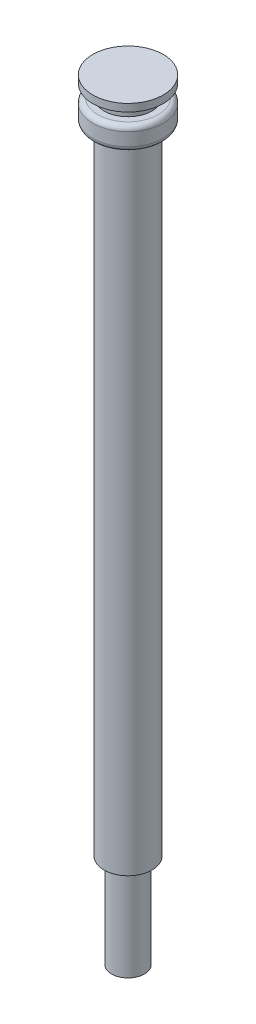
ISO-10303-21;
HEADER;
FILE_DESCRIPTION(('STEP AP214'),'2;1');
FILE_NAME('part.step','',(''),(''),'','','');
FILE_SCHEMA(('AUTOMOTIVE_DESIGN { 1 0 10303 214 1 1 1 1 }'));
ENDSEC;
DATA;
#1=APPLICATION_CONTEXT('core data for automotive mechanical design processes');
#2=APPLICATION_PROTOCOL_DEFINITION('international standard','automotive_design',2000,#1);
#3=PRODUCT_CONTEXT('',#1,'mechanical');
#4=PRODUCT('Part','Part','',(#3));
#5=PRODUCT_RELATED_PRODUCT_CATEGORY('part','',(#4));
#6=PRODUCT_DEFINITION_FORMATION('','',#4);
#7=PRODUCT_DEFINITION_CONTEXT('part definition',#1,'design');
#8=PRODUCT_DEFINITION('design','',#6,#7);
#9=PRODUCT_DEFINITION_SHAPE('','',#8);
#10=(LENGTH_UNIT() NAMED_UNIT(*) SI_UNIT(.MILLI.,.METRE.));
#11=(NAMED_UNIT(*) PLANE_ANGLE_UNIT() SI_UNIT($,.RADIAN.));
#12=(NAMED_UNIT(*) SI_UNIT($,.STERADIAN.) SOLID_ANGLE_UNIT());
#13=UNCERTAINTY_MEASURE_WITH_UNIT(LENGTH_MEASURE(1.E-05),#10,'distance_accuracy_value','');
#14=(GEOMETRIC_REPRESENTATION_CONTEXT(3) GLOBAL_UNCERTAINTY_ASSIGNED_CONTEXT((#13)) GLOBAL_UNIT_ASSIGNED_CONTEXT((#10,
#11,#12)) REPRESENTATION_CONTEXT('',''));
#15=CARTESIAN_POINT('',(0.,0.,0.));
#16=DIRECTION('',(0.,0.,1.));
#17=DIRECTION('',(1.,0.,0.));
#18=AXIS2_PLACEMENT_3D('',#15,#16,#17);
#19=CARTESIAN_POINT('',(1.6637,0.,0.));
#20=DIRECTION('',(0.,-1.,0.));
#21=DIRECTION('',(0.,0.,-1.));
#22=AXIS2_PLACEMENT_3D('',#19,#20,#21);
#23=PLANE('',#22);
#24=CARTESIAN_POINT('',(0.,0.,0.));
#25=DIRECTION('',(0.,-1.,0.));
#26=DIRECTION('',(0.,0.,-1.));
#27=AXIS2_PLACEMENT_3D('',#24,#25,#26);
#28=CIRCLE('',#27,1.6637);
#29=CARTESIAN_POINT('',(0.,0.,-1.6637));
#30=VERTEX_POINT('',#29);
#31=EDGE_CURVE('E53',#30,#30,#28,.T.);
#32=ORIENTED_EDGE('',*,*,#31,.T.);
#33=EDGE_LOOP('',(#32));
#34=FACE_BOUND('',#33,.T.);
#35=ADVANCED_FACE('F33',(#34),#23,.T.);
#36=CARTESIAN_POINT('',(0.,0.,0.));
#37=DIRECTION('',(0.,-1.,0.));
#38=DIRECTION('',(0.,0.,-1.));
#39=AXIS2_PLACEMENT_3D('',#36,#37,#38);
#40=CYLINDRICAL_SURFACE('',#39,1.6637);
#41=CARTESIAN_POINT('',(0.,9.525,0.));
#42=DIRECTION('',(0.,-1.,0.));
#43=DIRECTION('',(0.,0.,-1.));
#44=AXIS2_PLACEMENT_3D('',#41,#42,#43);
#45=CIRCLE('',#44,1.6637);
#46=CARTESIAN_POINT('',(0.,9.525,-1.6637));
#47=VERTEX_POINT('',#46);
#48=EDGE_CURVE('E56',#47,#47,#45,.T.);
#49=ORIENTED_EDGE('',*,*,#48,.T.);
#50=EDGE_LOOP('',(#49));
#51=FACE_BOUND('',#50,.T.);
#52=ORIENTED_EDGE('',*,*,#31,.F.);
#53=EDGE_LOOP('',(#52));
#54=FACE_BOUND('',#53,.T.);
#55=ADVANCED_FACE('F93',(#51,#54),#40,.T.);
#56=CARTESIAN_POINT('',(2.4384,9.525,0.));
#57=DIRECTION('',(0.,-1.,0.));
#58=DIRECTION('',(0.,0.,-1.));
#59=AXIS2_PLACEMENT_3D('',#56,#57,#58);
#60=PLANE('',#59);
#61=CARTESIAN_POINT('',(0.,9.525,0.));
#62=DIRECTION('',(0.,-1.,0.));
#63=DIRECTION('',(0.,0.,-1.));
#64=AXIS2_PLACEMENT_3D('',#61,#62,#63);
#65=CIRCLE('',#64,2.4384);
#66=CARTESIAN_POINT('',(0.,9.525,-2.4384));
#67=VERTEX_POINT('',#66);
#68=EDGE_CURVE('E59',#67,#67,#65,.T.);
#69=ORIENTED_EDGE('',*,*,#68,.T.);
#70=EDGE_LOOP('',(#69));
#71=FACE_BOUND('',#70,.T.);
#72=ORIENTED_EDGE('',*,*,#48,.F.);
#73=EDGE_LOOP('',(#72));
#74=FACE_BOUND('',#73,.T.);
#75=ADVANCED_FACE('F99',(#71,#74),#60,.T.);
#76=CARTESIAN_POINT('',(0.,0.,0.));
#77=DIRECTION('',(0.,-1.,0.));
#78=DIRECTION('',(0.,0.,-1.));
#79=AXIS2_PLACEMENT_3D('',#76,#77,#78);
#80=CYLINDRICAL_SURFACE('',#79,2.4384);
#81=CARTESIAN_POINT('',(0.,73.8632,0.));
#82=DIRECTION('',(0.,-1.,0.));
#83=DIRECTION('',(0.,0.,-1.));
#84=AXIS2_PLACEMENT_3D('',#81,#82,#83);
#85=CIRCLE('',#84,2.4384);
#86=CARTESIAN_POINT('',(0.,73.8632,-2.4384));
#87=VERTEX_POINT('',#86);
#88=EDGE_CURVE('E62',#87,#87,#85,.T.);
#89=ORIENTED_EDGE('',*,*,#88,.T.);
#90=EDGE_LOOP('',(#89));
#91=FACE_BOUND('',#90,.T.);
#92=ORIENTED_EDGE('',*,*,#68,.F.);
#93=EDGE_LOOP('',(#92));
#94=FACE_BOUND('',#93,.T.);
#95=ADVANCED_FACE('F105',(#91,#94),#80,.T.);
#96=CARTESIAN_POINT('',(2.4384,73.8632,0.));
#97=DIRECTION('',(0.,-1.,0.));
#98=DIRECTION('',(0.,0.,-1.));
#99=AXIS2_PLACEMENT_3D('',#96,#97,#98);
#100=PLANE('',#99);
#101=CARTESIAN_POINT('',(0.,73.8632,0.));
#102=DIRECTION('',(0.,-1.,0.));
#103=DIRECTION('',(0.,0.,-1.));
#104=AXIS2_PLACEMENT_3D('',#101,#102,#103);
#105=CIRCLE('',#104,3.0607);
#106=CARTESIAN_POINT('',(0.,73.8632,-3.0607));
#107=VERTEX_POINT('',#106);
#108=EDGE_CURVE('E10',#107,#107,#105,.T.);
#109=ORIENTED_EDGE('',*,*,#108,.T.);
#110=EDGE_LOOP('',(#109));
#111=FACE_BOUND('',#110,.T.);
#112=ORIENTED_EDGE('',*,*,#88,.F.);
#113=EDGE_LOOP('',(#112));
#114=FACE_BOUND('',#113,.T.);
#115=ADVANCED_FACE('F109',(#111,#114),#100,.T.);
#116=CARTESIAN_POINT('',(0.,0.,0.));
#117=DIRECTION('',(0.,-1.,0.));
#118=DIRECTION('',(0.,0.,-1.));
#119=AXIS2_PLACEMENT_3D('',#116,#117,#118);
#120=CYLINDRICAL_SURFACE('',#119,3.5687);
#121=CARTESIAN_POINT('',(0.,75.692,0.));
#122=DIRECTION('',(0.,1.,0.));
#123=DIRECTION('',(0.,0.,1.));
#124=AXIS2_PLACEMENT_3D('',#121,#122,#123);
#125=CIRCLE('',#124,3.5687);
#126=CARTESIAN_POINT('',(0.,75.692,3.5687));
#127=VERTEX_POINT('',#126);
#128=EDGE_CURVE('E44',#127,#127,#125,.F.);
#129=ORIENTED_EDGE('',*,*,#128,.T.);
#130=EDGE_LOOP('',(#129));
#131=FACE_BOUND('',#130,.T.);
#132=CARTESIAN_POINT('',(0.,74.3712,0.));
#133=DIRECTION('',(0.,-1.,0.));
#134=DIRECTION('',(0.,0.,-1.));
#135=AXIS2_PLACEMENT_3D('',#132,#133,#134);
#136=CIRCLE('',#135,3.5687);
#137=CARTESIAN_POINT('',(0.,74.3712,-3.5687));
#138=VERTEX_POINT('',#137);
#139=EDGE_CURVE('E48',#138,#138,#136,.F.);
#140=ORIENTED_EDGE('',*,*,#139,.T.);
#141=EDGE_LOOP('',(#140));
#142=FACE_BOUND('',#141,.T.);
#143=ADVANCED_FACE('F113',(#131,#142),#120,.T.);
#144=CARTESIAN_POINT('',(3.5687,76.2,0.));
#145=DIRECTION('',(0.,1.,0.));
#146=DIRECTION('',(0.,0.,1.));
#147=AXIS2_PLACEMENT_3D('',#144,#145,#146);
#148=PLANE('',#147);
#149=CARTESIAN_POINT('',(0.,76.2,0.));
#150=DIRECTION('',(0.,1.,0.));
#151=DIRECTION('',(0.,0.,1.));
#152=AXIS2_PLACEMENT_3D('',#149,#150,#151);
#153=CIRCLE('',#152,3.0607);
#154=CARTESIAN_POINT('',(0.,76.2,3.0607));
#155=VERTEX_POINT('',#154);
#156=EDGE_CURVE('E40',#155,#155,#153,.T.);
#157=ORIENTED_EDGE('',*,*,#156,.T.);
#158=EDGE_LOOP('',(#157));
#159=FACE_BOUND('',#158,.T.);
#160=CARTESIAN_POINT('',(0.,76.2,0.));
#161=DIRECTION('',(0.,-1.,0.));
#162=DIRECTION('',(0.,0.,-1.));
#163=AXIS2_PLACEMENT_3D('',#160,#161,#162);
#164=CIRCLE('',#163,2.4257);
#165=CARTESIAN_POINT('',(0.,76.2,-2.4257));
#166=VERTEX_POINT('',#165);
#167=EDGE_CURVE('E65',#166,#166,#164,.T.);
#168=ORIENTED_EDGE('',*,*,#167,.T.);
#169=EDGE_LOOP('',(#168));
#170=FACE_BOUND('',#169,.T.);
#171=ADVANCED_FACE('F116',(#159,#170),#148,.T.);
#172=CARTESIAN_POINT('',(0.,0.,0.));
#173=DIRECTION('',(0.,-1.,0.));
#174=DIRECTION('',(0.,0.,-1.));
#175=AXIS2_PLACEMENT_3D('',#172,#173,#174);
#176=CYLINDRICAL_SURFACE('',#175,2.4257);
#177=CARTESIAN_POINT('',(0.,77.4192,0.));
#178=DIRECTION('',(0.,-1.,0.));
#179=DIRECTION('',(0.,0.,-1.));
#180=AXIS2_PLACEMENT_3D('',#177,#178,#179);
#181=CIRCLE('',#180,2.4257);
#182=CARTESIAN_POINT('',(0.,77.4192,-2.4257));
#183=VERTEX_POINT('',#182);
#184=EDGE_CURVE('E68',#183,#183,#181,.T.);
#185=ORIENTED_EDGE('',*,*,#184,.T.);
#186=EDGE_LOOP('',(#185));
#187=FACE_BOUND('',#186,.T.);
#188=ORIENTED_EDGE('',*,*,#167,.F.);
#189=EDGE_LOOP('',(#188));
#190=FACE_BOUND('',#189,.T.);
#191=ADVANCED_FACE('F120',(#187,#190),#176,.T.);
#192=CARTESIAN_POINT('',(2.4257,77.4192,0.));
#193=DIRECTION('',(0.,-1.,0.));
#194=DIRECTION('',(0.,0.,-1.));
#195=AXIS2_PLACEMENT_3D('',#192,#193,#194);
#196=PLANE('',#195);
#197=CARTESIAN_POINT('',(0.,77.4192,0.));
#198=DIRECTION('',(0.,-1.,0.));
#199=DIRECTION('',(0.,0.,-1.));
#200=AXIS2_PLACEMENT_3D('',#197,#198,#199);
#201=CIRCLE('',#200,3.5687);
#202=CARTESIAN_POINT('',(0.,77.4192,-3.5687));
#203=VERTEX_POINT('',#202);
#204=EDGE_CURVE('E71',#203,#203,#201,.T.);
#205=ORIENTED_EDGE('',*,*,#204,.T.);
#206=EDGE_LOOP('',(#205));
#207=FACE_BOUND('',#206,.T.);
#208=ORIENTED_EDGE('',*,*,#184,.F.);
#209=EDGE_LOOP('',(#208));
#210=FACE_BOUND('',#209,.T.);
#211=ADVANCED_FACE('F90',(#207,#210),#196,.T.);
#212=CARTESIAN_POINT('',(0.,0.,0.));
#213=DIRECTION('',(0.,-1.,0.));
#214=DIRECTION('',(0.,0.,-1.));
#215=AXIS2_PLACEMENT_3D('',#212,#213,#214);
#216=CYLINDRICAL_SURFACE('',#215,3.5687);
#217=CARTESIAN_POINT('',(0.,78.1812,0.));
#218=DIRECTION('',(0.,-1.,0.));
#219=DIRECTION('',(0.,0.,-1.));
#220=AXIS2_PLACEMENT_3D('',#217,#218,#219);
#221=CIRCLE('',#220,3.5687);
#222=CARTESIAN_POINT('',(0.,78.1812,-3.5687));
#223=VERTEX_POINT('',#222);
#224=EDGE_CURVE('E74',#223,#223,#221,.T.);
#225=ORIENTED_EDGE('',*,*,#224,.T.);
#226=EDGE_LOOP('',(#225));
#227=FACE_BOUND('',#226,.T.);
#228=ORIENTED_EDGE('',*,*,#204,.F.);
#229=EDGE_LOOP('',(#228));
#230=FACE_BOUND('',#229,.T.);
#231=ADVANCED_FACE('F78',(#227,#230),#216,.T.);
#232=CARTESIAN_POINT('',(3.5687,78.1812,0.));
#233=DIRECTION('',(0.,1.,0.));
#234=DIRECTION('',(0.,0.,1.));
#235=AXIS2_PLACEMENT_3D('',#232,#233,#234);
#236=PLANE('',#235);
#237=ORIENTED_EDGE('',*,*,#224,.F.);
#238=EDGE_LOOP('',(#237));
#239=FACE_BOUND('',#238,.T.);
#240=ADVANCED_FACE('F81',(#239),#236,.T.);
#241=CARTESIAN_POINT('',(0.,75.692,0.));
#242=DIRECTION('',(0.,1.,0.));
#243=DIRECTION('',(0.,0.,1.));
#244=AXIS2_PLACEMENT_3D('',#241,#242,#243);
#245=TOROIDAL_SURFACE('',#244,3.0607,0.508);
#246=ORIENTED_EDGE('',*,*,#156,.F.);
#247=EDGE_LOOP('',(#246));
#248=FACE_BOUND('',#247,.T.);
#249=ORIENTED_EDGE('',*,*,#128,.F.);
#250=EDGE_LOOP('',(#249));
#251=FACE_BOUND('',#250,.T.);
#252=ADVANCED_FACE('F83',(#248,#251),#245,.T.);
#253=CARTESIAN_POINT('',(0.,74.3712,0.));
#254=DIRECTION('',(0.,-1.,0.));
#255=DIRECTION('',(0.,0.,-1.));
#256=AXIS2_PLACEMENT_3D('',#253,#254,#255);
#257=TOROIDAL_SURFACE('',#256,3.0607,0.508);
#258=ORIENTED_EDGE('',*,*,#139,.F.);
#259=EDGE_LOOP('',(#258));
#260=FACE_BOUND('',#259,.T.);
#261=ORIENTED_EDGE('',*,*,#108,.F.);
#262=EDGE_LOOP('',(#261));
#263=FACE_BOUND('',#262,.T.);
#264=ADVANCED_FACE('F35',(#260,#263),#257,.T.);
#265=CLOSED_SHELL('',(#35,#55,#75,#95,#115,#143,#171,#191,#211,#231,#240,#252,#264));
#266=MANIFOLD_SOLID_BREP('B2',#265);
#267=ADVANCED_BREP_SHAPE_REPRESENTATION('',(#18,#266),#14);
#268=SHAPE_DEFINITION_REPRESENTATION(#9,#267);
ENDSEC;
END-ISO-10303-21;
